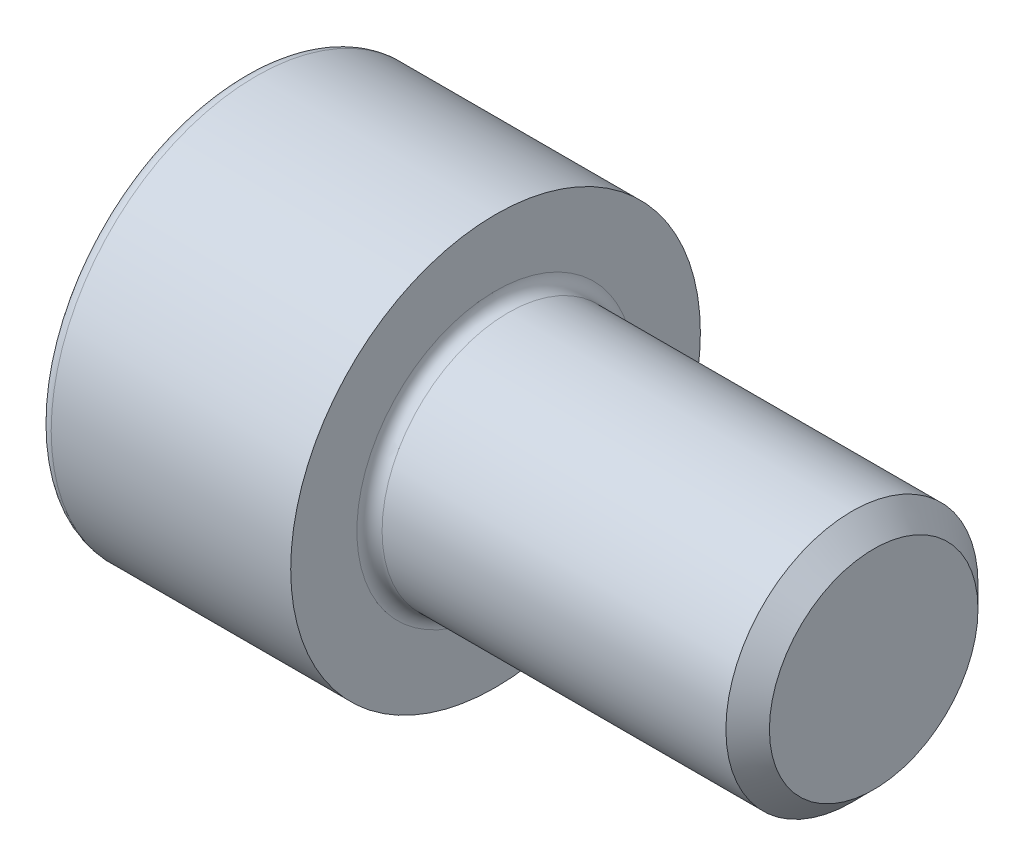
from build123d import *

# Parameters (mm, degrees)
FILLET1_R   = 0.4
FILLET2_R   = 0.4
HEX_2_DEPTH = 4


with BuildPart() as part:
    # BodySke → Base-Revolve (revolve)
    with BuildSketch(Plane.XY, mode=Mode.PRIVATE) as base_revolve_sk:
        Polygon((0, 0), (0, 6.5), (8, 6.5), (8, 4), (19.3095, 4), (20, 3.3095), (20, 0), align=None)
    revolve(base_revolve_sk.sketch.rotate(Axis((-31.75, 0, 0), (1, 0, 0)), 90), axis=Axis((-31.75, 0, 0), (1, 0, 0)))

    # Fillet1
    fillet1_edges = [part.edges().sort_by_distance(p)[0] for p in [
        (8, 0, -4),
    ]]
    fillet(fillet1_edges, radius=FILLET1_R)

    # Fillet2
    fillet2_edges = [part.edges().sort_by_distance(p)[0] for p in [
        (0, 0, -6.5),
    ]]
    fillet(fillet2_edges, radius=FILLET2_R)

    # Sketch2 → Hex-PreBroach (revolve, cut)
    with BuildSketch(Plane.XY, mode=Mode.PRIVATE) as hex_prebroach_sk:
        Polygon((0, 3.0475), (4, 3.0475), (5.759474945, 0), (0, 0), align=None)
    revolve(hex_prebroach_sk.sketch.rotate(Axis((0, 0, 0), (1, 0, 0)), 90), axis=Axis((0, 0, 0), (1, 0, 0)), mode=Mode.SUBTRACT)

    # Sketch3 → Hex 2 (cut)
    with BuildSketch(Plane(origin=(0, 0, 0), x_dir=(0, 0.500000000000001, 0.866025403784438), z_dir=(-1, 0, 0))):
        Polygon((1.759474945, 3.0475), (-1.759474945, 3.0475), (-3.518949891, 0), (-1.759474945, -3.0475), (1.759474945, -3.0475), (3.518949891, 0), align=None)
    extrude(amount=-HEX_2_DEPTH, mode=Mode.SUBTRACT)


solid = part.part
